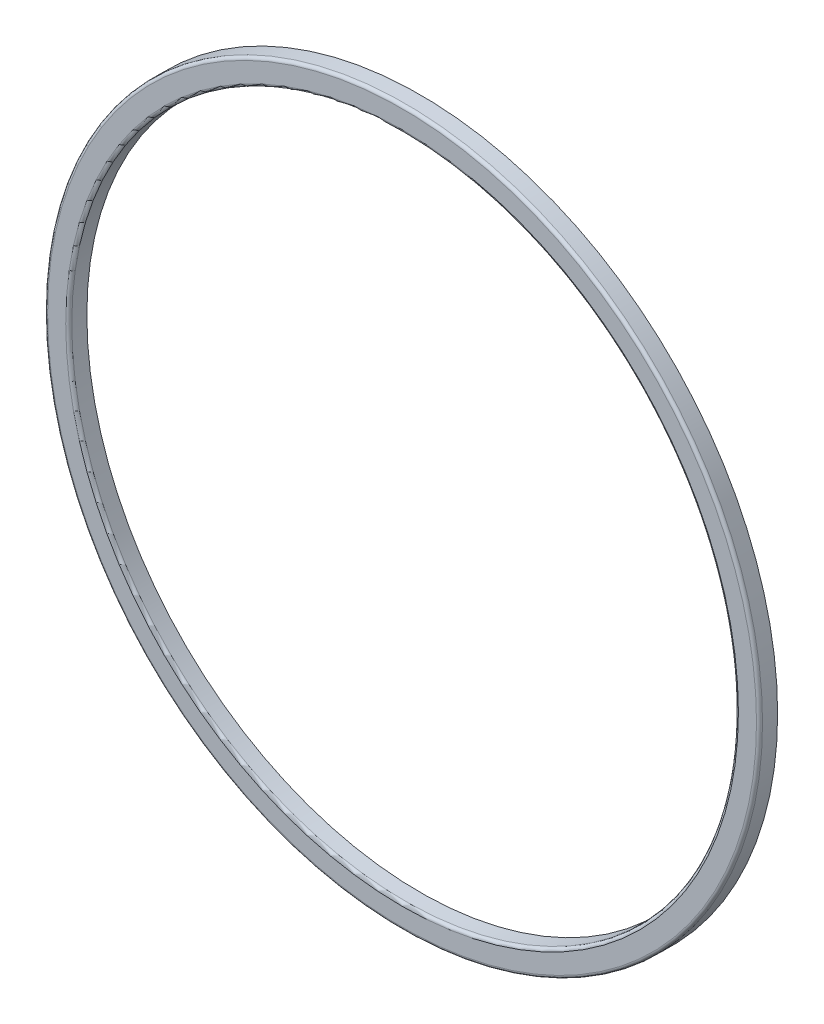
ISO-10303-21;
HEADER;
FILE_DESCRIPTION(('STEP AP214'),'2;1');
FILE_NAME('part.step','',(''),(''),'','','');
FILE_SCHEMA(('AUTOMOTIVE_DESIGN { 1 0 10303 214 1 1 1 1 }'));
ENDSEC;
DATA;
#1=APPLICATION_CONTEXT('core data for automotive mechanical design processes');
#2=APPLICATION_PROTOCOL_DEFINITION('international standard','automotive_design',2000,#1);
#3=PRODUCT_CONTEXT('',#1,'mechanical');
#4=PRODUCT('Part','Part','',(#3));
#5=PRODUCT_RELATED_PRODUCT_CATEGORY('part','',(#4));
#6=PRODUCT_DEFINITION_FORMATION('','',#4);
#7=PRODUCT_DEFINITION_CONTEXT('part definition',#1,'design');
#8=PRODUCT_DEFINITION('design','',#6,#7);
#9=PRODUCT_DEFINITION_SHAPE('','',#8);
#10=(LENGTH_UNIT() NAMED_UNIT(*) SI_UNIT(.MILLI.,.METRE.));
#11=(NAMED_UNIT(*) PLANE_ANGLE_UNIT() SI_UNIT($,.RADIAN.));
#12=(NAMED_UNIT(*) SI_UNIT($,.STERADIAN.) SOLID_ANGLE_UNIT());
#13=UNCERTAINTY_MEASURE_WITH_UNIT(LENGTH_MEASURE(1.E-05),#10,'distance_accuracy_value','');
#14=(GEOMETRIC_REPRESENTATION_CONTEXT(3) GLOBAL_UNCERTAINTY_ASSIGNED_CONTEXT((#13)) GLOBAL_UNIT_ASSIGNED_CONTEXT((#10,
#11,#12)) REPRESENTATION_CONTEXT('',''));
#15=CARTESIAN_POINT('',(0.,0.,0.));
#16=DIRECTION('',(0.,0.,1.));
#17=DIRECTION('',(1.,0.,0.));
#18=AXIS2_PLACEMENT_3D('',#15,#16,#17);
#19=CARTESIAN_POINT('',(-25.5,66.46,11.));
#20=DIRECTION('',(0.,0.,1.));
#21=DIRECTION('',(1.,0.,0.));
#22=AXIS2_PLACEMENT_3D('',#19,#20,#21);
#23=PLANE('',#22);
#24=CARTESIAN_POINT('',(-25.5,66.46,11.));
#25=DIRECTION('',(0.,0.,1.));
#26=DIRECTION('',(-1.,0.,0.));
#27=AXIS2_PLACEMENT_3D('',#24,#25,#26);
#28=CIRCLE('',#27,5.575);
#29=CARTESIAN_POINT('',(-31.075,66.46,11.));
#30=VERTEX_POINT('',#29);
#31=EDGE_CURVE('E68',#30,#30,#28,.T.);
#32=ORIENTED_EDGE('',*,*,#31,.F.);
#33=EDGE_LOOP('',(#32));
#34=FACE_BOUND('',#33,.T.);
#35=CARTESIAN_POINT('',(-25.5,66.46,11.));
#36=DIRECTION('',(0.,0.,-1.));
#37=DIRECTION('',(-1.,0.,0.));
#38=AXIS2_PLACEMENT_3D('',#35,#36,#37);
#39=CIRCLE('',#38,5.875);
#40=CARTESIAN_POINT('',(-31.375,66.46,11.));
#41=VERTEX_POINT('',#40);
#42=EDGE_CURVE('E55',#41,#41,#39,.T.);
#43=ORIENTED_EDGE('',*,*,#42,.F.);
#44=EDGE_LOOP('',(#43));
#45=FACE_BOUND('',#44,.T.);
#46=ADVANCED_FACE('F15',(#34,#45),#23,.T.);
#47=CARTESIAN_POINT('',(-25.5,66.46,10.95));
#48=DIRECTION('',(0.,0.,1.));
#49=DIRECTION('',(1.,0.,0.));
#50=AXIS2_PLACEMENT_3D('',#47,#48,#49);
#51=TOROIDAL_SURFACE('',#50,5.875,0.05);
#52=CARTESIAN_POINT('',(-25.5,66.46,10.95));
#53=DIRECTION('',(0.,0.,-1.));
#54=DIRECTION('',(-1.,0.,0.));
#55=AXIS2_PLACEMENT_3D('',#52,#53,#54);
#56=CIRCLE('',#55,5.925);
#57=CARTESIAN_POINT('',(-31.425,66.46,10.95));
#58=VERTEX_POINT('',#57);
#59=EDGE_CURVE('E86',#58,#58,#56,.T.);
#60=ORIENTED_EDGE('',*,*,#59,.F.);
#61=EDGE_LOOP('',(#60));
#62=FACE_BOUND('',#61,.T.);
#63=ORIENTED_EDGE('',*,*,#42,.T.);
#64=EDGE_LOOP('',(#63));
#65=FACE_BOUND('',#64,.T.);
#66=ADVANCED_FACE('F33',(#62,#65),#51,.T.);
#67=CARTESIAN_POINT('',(-25.5,66.46,10.95));
#68=DIRECTION('',(0.,0.,1.));
#69=DIRECTION('',(1.,0.,0.));
#70=AXIS2_PLACEMENT_3D('',#67,#68,#69);
#71=TOROIDAL_SURFACE('',#70,5.575,0.05);
#72=ORIENTED_EDGE('',*,*,#31,.T.);
#73=EDGE_LOOP('',(#72));
#74=FACE_BOUND('',#73,.T.);
#75=CARTESIAN_POINT('',(-25.5,66.46,10.95));
#76=DIRECTION('',(0.,0.,-1.));
#77=DIRECTION('',(-1.,0.,0.));
#78=AXIS2_PLACEMENT_3D('',#75,#76,#77);
#79=CIRCLE('',#78,5.525);
#80=CARTESIAN_POINT('',(-31.025,66.46,10.95));
#81=VERTEX_POINT('',#80);
#82=EDGE_CURVE('E26',#81,#81,#79,.T.);
#83=ORIENTED_EDGE('',*,*,#82,.T.);
#84=EDGE_LOOP('',(#83));
#85=FACE_BOUND('',#84,.T.);
#86=ADVANCED_FACE('F43',(#74,#85),#71,.T.);
#87=CARTESIAN_POINT('',(-25.5,66.46,11.));
#88=DIRECTION('',(0.,0.,-1.));
#89=DIRECTION('',(-1.,0.,0.));
#90=AXIS2_PLACEMENT_3D('',#87,#88,#89);
#91=CYLINDRICAL_SURFACE('',#90,5.925);
#92=ORIENTED_EDGE('',*,*,#59,.T.);
#93=EDGE_LOOP('',(#92));
#94=FACE_BOUND('',#93,.T.);
#95=CARTESIAN_POINT('',(-25.5,66.46,10.7));
#96=DIRECTION('',(0.,0.,-1.));
#97=DIRECTION('',(-1.,0.,0.));
#98=AXIS2_PLACEMENT_3D('',#95,#96,#97);
#99=CIRCLE('',#98,5.925);
#100=CARTESIAN_POINT('',(-31.425,66.46,10.7));
#101=VERTEX_POINT('',#100);
#102=EDGE_CURVE('E19',#101,#101,#99,.F.);
#103=ORIENTED_EDGE('',*,*,#102,.T.);
#104=EDGE_LOOP('',(#103));
#105=FACE_BOUND('',#104,.T.);
#106=ADVANCED_FACE('F98',(#94,#105),#91,.T.);
#107=CARTESIAN_POINT('',(-25.5,66.46,11.));
#108=DIRECTION('',(0.,0.,-1.));
#109=DIRECTION('',(-1.,0.,0.));
#110=AXIS2_PLACEMENT_3D('',#107,#108,#109);
#111=CYLINDRICAL_SURFACE('',#110,5.525);
#112=CARTESIAN_POINT('',(-25.5,66.46,10.7));
#113=DIRECTION('',(0.,0.,-1.));
#114=DIRECTION('',(-1.,0.,0.));
#115=AXIS2_PLACEMENT_3D('',#112,#113,#114);
#116=CIRCLE('',#115,5.525);
#117=CARTESIAN_POINT('',(-31.025,66.46,10.7));
#118=VERTEX_POINT('',#117);
#119=EDGE_CURVE('E10',#118,#118,#116,.T.);
#120=ORIENTED_EDGE('',*,*,#119,.T.);
#121=EDGE_LOOP('',(#120));
#122=FACE_BOUND('',#121,.T.);
#123=ORIENTED_EDGE('',*,*,#82,.F.);
#124=EDGE_LOOP('',(#123));
#125=FACE_BOUND('',#124,.T.);
#126=ADVANCED_FACE('F95',(#122,#125),#111,.F.);
#127=CARTESIAN_POINT('',(-25.5,66.46,10.7));
#128=DIRECTION('',(0.,0.,1.));
#129=DIRECTION('',(1.,0.,0.));
#130=AXIS2_PLACEMENT_3D('',#127,#128,#129);
#131=PLANE('',#130);
#132=ORIENTED_EDGE('',*,*,#119,.F.);
#133=EDGE_LOOP('',(#132));
#134=FACE_BOUND('',#133,.T.);
#135=ORIENTED_EDGE('',*,*,#102,.F.);
#136=EDGE_LOOP('',(#135));
#137=FACE_BOUND('',#136,.T.);
#138=ADVANCED_FACE('F97',(#134,#137),#131,.F.);
#139=CLOSED_SHELL('',(#46,#66,#86,#106,#126,#138));
#140=MANIFOLD_SOLID_BREP('B1',#139);
#141=ADVANCED_BREP_SHAPE_REPRESENTATION('',(#18,#140),#14);
#142=SHAPE_DEFINITION_REPRESENTATION(#9,#141);
ENDSEC;
END-ISO-10303-21;
